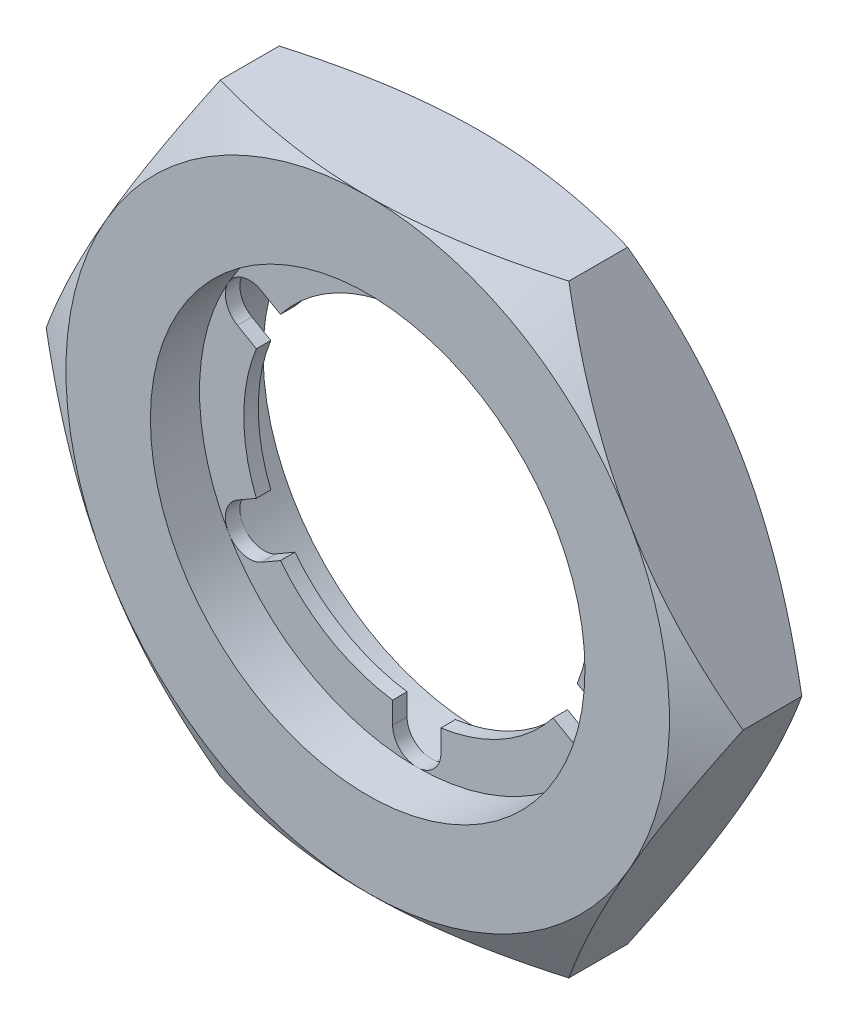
from build123d import *

# Parameters (mm, degrees)
SKETCH1_R          = 21.5
BASENUT_DEPTH      = 14
CUT_EXTRUDE1_DEPTH = 86.27020198
CIRPATTERN1_COUNT  = 6
SKETCH4_R          = 27
CUT_EXTRUDE2_DEPTH = 6.1


with BuildPart() as part:
    # Sketch1 → BaseNut (new body)
    with BuildSketch(Plane.XY):
        Polygon((21.650635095, -37.5), (43.301270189, 0), (21.650635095, 37.5), (-21.650635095, 37.5), (-43.301270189, 0), (-21.650635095, -37.5), align=None)
        Circle(SKETCH1_R, mode=Mode.SUBTRACT)
    extrude(amount=-BASENUT_DEPTH)

    # Sketch2 → DoubleChamfer (revolve, cut)
    with BuildSketch(Plane(origin=(23.522643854, 0, -24.740081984), x_dir=(0, 0, -1), z_dir=(0, 1, 0))):
        Polygon((-24.740081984, 61.022643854), (-21.390717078, 66.823914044), (-24.740081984, 66.823914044), align=None)
        Polygon((-10.740081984, 66.823914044), (-10.740081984, 61.022643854), (-14.089446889, 66.823914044), align=None)
    revolve(axis=Axis((0, 0, -13.261379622), (0, 0, -1)), mode=Mode.SUBTRACT)

    # Sketch3 → Cut-Extrude1 (cut, through all)
    with BuildSketch(Plane(origin=(13.786830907, 24.273425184, 0), x_dir=(0.866025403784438, 0.500000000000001, 0), z_dir=(0, 0, 1))):
        with BuildLine():
            Line((-0.076458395, -11.127987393), (-2.786789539, -11.127987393))
            ThreePointArc((-2.786789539, -11.127987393), (-2.576458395, -14.127987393), (-2.786789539, -17.127987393))
            Line((-2.786789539, -17.127987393), (-0.076458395, -17.127987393))
            ThreePointArc((-0.076458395, -17.127987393), (2.923541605, -14.127987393), (-0.076458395, -11.127987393))
        make_face()
    cut_extrude1 = extrude(amount=-CUT_EXTRUDE1_DEPTH, mode=Mode.SUBTRACT)

    # CirPattern1: Cut-Extrude1 ×6 about axis
    cirpattern1_axis = Axis((0, 0, 0), (0, 0, 1))
    for i in range(1, CIRPATTERN1_COUNT):
        add(cut_extrude1.rotate(cirpattern1_axis, i * 360 / CIRPATTERN1_COUNT), mode=Mode.SUBTRACT)

    # Sketch4 → Cut-Extrude2 (cut)
    with BuildSketch(Plane(origin=(12.770536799, 22.97900388, 0), x_dir=(1, 0, 0), z_dir=(0, 0, 1))):
        with Locations((-12.770536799, -22.97900388)):
            Circle(SKETCH4_R)
    cut_extrude2 = extrude(amount=-CUT_EXTRUDE2_DEPTH, mode=Mode.SUBTRACT)

    # Mirror1: Cut-Extrude2 across plane
    add(cut_extrude2.mirror(Plane.XY.offset(-7)), mode=Mode.SUBTRACT)


solid = part.part
